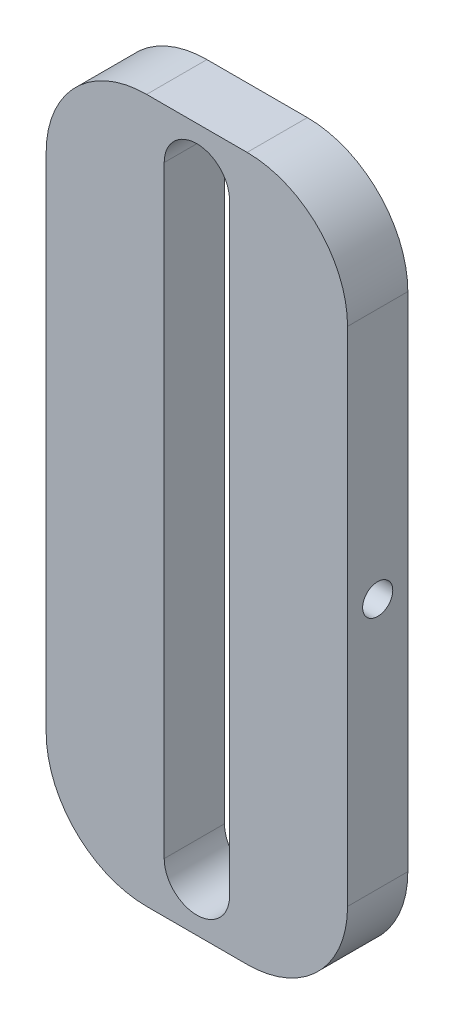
from build123d import *

# Parameters (mm, degrees)
SKETCH1_W      = 30
SKETCH1_H      = 70
EXTRUDE1_DEPTH = 6
SKETCH2_R      = 1.5
EXTRUDE2_DEPTH = 10
FILLET1_R      = 10


with BuildPart() as part:
    # Sketch1 → Extrude1 (new body)
    with BuildSketch(Plane.XY):
        with Locations((15, 35)):
            Rectangle(SKETCH1_W, SKETCH1_H)
        with BuildLine():
            Line((18.25, 5), (18.25, 65))
            ThreePointArc((18.25, 65), (15, 68.25), (11.75, 65))
            Line((11.75, 65), (11.75, 5))
            ThreePointArc((11.75, 5), (15, 1.75), (18.25, 5))
        make_face(mode=Mode.SUBTRACT)
    extrude(amount=EXTRUDE1_DEPTH)

    # Sketch2 → Extrude2 (cut)
    with BuildSketch(Plane(origin=(30, 0, 0), x_dir=(0, 0, -1), z_dir=(1, 0, 0))):
        with Locations((-3, 35)):
            Circle(SKETCH2_R)
    extrude2 = extrude(amount=-EXTRUDE2_DEPTH, mode=Mode.SUBTRACT)

    # Mirror1: Extrude2 across plane
    add(extrude2.mirror(Plane(origin=(15, 0, 0), x_dir=(0, 0, 1), z_dir=(1, 0, 0))), mode=Mode.SUBTRACT)

    # Fillet1
    fillet1_edges = [part.edges().sort_by_distance(p)[0] for p in [
        (0, 70, 3),
        (30, 70, 3),
        (30, 0, 3),
        (0, 0, 3),
    ]]
    fillet(fillet1_edges, radius=FILLET1_R)


solid = part.part
